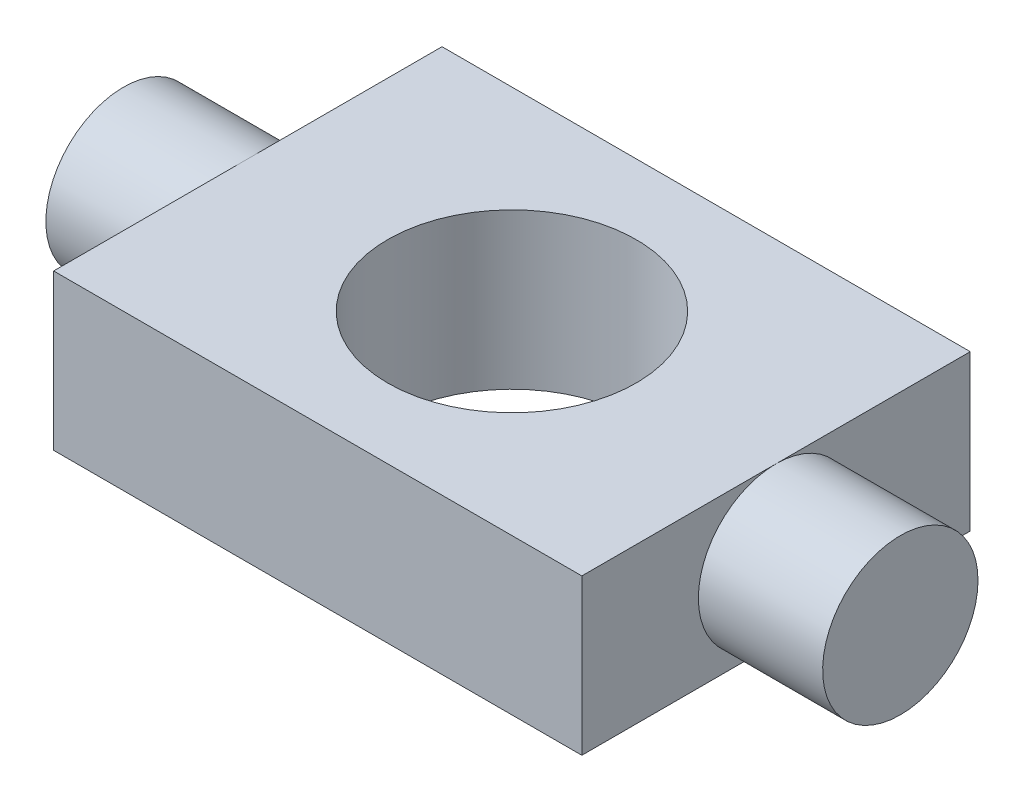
ISO-10303-21;
HEADER;
FILE_DESCRIPTION(('STEP AP214'),'2;1');
FILE_NAME('part.step','',(''),(''),'','','');
FILE_SCHEMA(('AUTOMOTIVE_DESIGN { 1 0 10303 214 1 1 1 1 }'));
ENDSEC;
DATA;
#1=APPLICATION_CONTEXT('core data for automotive mechanical design processes');
#2=APPLICATION_PROTOCOL_DEFINITION('international standard','automotive_design',2000,#1);
#3=PRODUCT_CONTEXT('',#1,'mechanical');
#4=PRODUCT('Part','Part','',(#3));
#5=PRODUCT_RELATED_PRODUCT_CATEGORY('part','',(#4));
#6=PRODUCT_DEFINITION_FORMATION('','',#4);
#7=PRODUCT_DEFINITION_CONTEXT('part definition',#1,'design');
#8=PRODUCT_DEFINITION('design','',#6,#7);
#9=PRODUCT_DEFINITION_SHAPE('','',#8);
#10=(LENGTH_UNIT() NAMED_UNIT(*) SI_UNIT(.MILLI.,.METRE.));
#11=(NAMED_UNIT(*) PLANE_ANGLE_UNIT() SI_UNIT($,.RADIAN.));
#12=(NAMED_UNIT(*) SI_UNIT($,.STERADIAN.) SOLID_ANGLE_UNIT());
#13=UNCERTAINTY_MEASURE_WITH_UNIT(LENGTH_MEASURE(1.E-05),#10,'distance_accuracy_value','');
#14=(GEOMETRIC_REPRESENTATION_CONTEXT(3) GLOBAL_UNCERTAINTY_ASSIGNED_CONTEXT((#13)) GLOBAL_UNIT_ASSIGNED_CONTEXT((#10,
#11,#12)) REPRESENTATION_CONTEXT('',''));
#15=CARTESIAN_POINT('',(0.,0.,0.));
#16=DIRECTION('',(0.,0.,1.));
#17=DIRECTION('',(1.,0.,0.));
#18=AXIS2_PLACEMENT_3D('',#15,#16,#17);
#19=CARTESIAN_POINT('',(0.,0.,25.));
#20=DIRECTION('',(1.,0.,0.));
#21=DIRECTION('',(0.,0.,-1.));
#22=AXIS2_PLACEMENT_3D('',#19,#20,#21);
#23=PLANE('',#22);
#24=DIRECTION('',(0.,0.,-1.));
#25=VECTOR('',#24,1.);
#26=CARTESIAN_POINT('',(0.,10.,25.));
#27=LINE('',#26,#25);
#28=CARTESIAN_POINT('',(0.,10.,25.));
#29=VERTEX_POINT('',#28);
#30=CARTESIAN_POINT('',(0.,10.,12.5));
#31=VERTEX_POINT('',#30);
#32=EDGE_CURVE('E85',#29,#31,#27,.T.);
#33=ORIENTED_EDGE('',*,*,#32,.T.);
#34=CARTESIAN_POINT('',(0.,5.,12.5));
#35=DIRECTION('',(1.,0.,0.));
#36=DIRECTION('',(0.,0.,-1.));
#37=AXIS2_PLACEMENT_3D('',#34,#35,#36);
#38=CIRCLE('',#37,5.);
#39=CARTESIAN_POINT('',(0.,0.,12.5));
#40=VERTEX_POINT('',#39);
#41=EDGE_CURVE('E35',#31,#40,#38,.T.);
#42=ORIENTED_EDGE('',*,*,#41,.T.);
#43=DIRECTION('',(0.,0.,-1.));
#44=VECTOR('',#43,1.);
#45=CARTESIAN_POINT('',(0.,0.,25.));
#46=LINE('',#45,#44);
#47=CARTESIAN_POINT('',(0.,0.,25.));
#48=VERTEX_POINT('',#47);
#49=EDGE_CURVE('E28',#48,#40,#46,.T.);
#50=ORIENTED_EDGE('',*,*,#49,.F.);
#51=DIRECTION('',(0.,-1.,0.));
#52=VECTOR('',#51,1.);
#53=CARTESIAN_POINT('',(0.,0.,25.));
#54=LINE('',#53,#52);
#55=EDGE_CURVE('E223',#29,#48,#54,.T.);
#56=ORIENTED_EDGE('',*,*,#55,.F.);
#57=EDGE_LOOP('',(#33,#42,#50,#56));
#58=FACE_BOUND('',#57,.T.);
#59=ADVANCED_FACE('F24',(#58),#23,.F.);
#60=CARTESIAN_POINT('',(34.,0.,25.));
#61=DIRECTION('',(-1.,0.,0.));
#62=DIRECTION('',(0.,0.,1.));
#63=AXIS2_PLACEMENT_3D('',#60,#61,#62);
#64=PLANE('',#63);
#65=CARTESIAN_POINT('',(34.,5.,12.5));
#66=DIRECTION('',(1.,0.,0.));
#67=DIRECTION('',(0.,0.,-1.));
#68=AXIS2_PLACEMENT_3D('',#65,#66,#67);
#69=CIRCLE('',#68,5.);
#70=CARTESIAN_POINT('',(34.,10.,12.5));
#71=VERTEX_POINT('',#70);
#72=CARTESIAN_POINT('',(34.,0.,12.5));
#73=VERTEX_POINT('',#72);
#74=EDGE_CURVE('E100',#71,#73,#69,.T.);
#75=ORIENTED_EDGE('',*,*,#74,.F.);
#76=DIRECTION('',(0.,0.,-1.));
#77=VECTOR('',#76,1.);
#78=CARTESIAN_POINT('',(34.,10.,25.));
#79=LINE('',#78,#77);
#80=CARTESIAN_POINT('',(34.,10.,25.));
#81=VERTEX_POINT('',#80);
#82=EDGE_CURVE('E233',#81,#71,#79,.T.);
#83=ORIENTED_EDGE('',*,*,#82,.F.);
#84=DIRECTION('',(0.,1.,0.));
#85=VECTOR('',#84,1.);
#86=CARTESIAN_POINT('',(34.,0.,25.));
#87=LINE('',#86,#85);
#88=CARTESIAN_POINT('',(34.,0.,25.));
#89=VERTEX_POINT('',#88);
#90=EDGE_CURVE('E226',#89,#81,#87,.T.);
#91=ORIENTED_EDGE('',*,*,#90,.F.);
#92=DIRECTION('',(0.,0.,-1.));
#93=VECTOR('',#92,1.);
#94=CARTESIAN_POINT('',(34.,0.,25.));
#95=LINE('',#94,#93);
#96=EDGE_CURVE('E94',#89,#73,#95,.T.);
#97=ORIENTED_EDGE('',*,*,#96,.T.);
#98=EDGE_LOOP('',(#75,#83,#91,#97));
#99=FACE_BOUND('',#98,.T.);
#100=ADVANCED_FACE('F122',(#99),#64,.F.);
#101=EDGE_CURVE('E33',#73,#71,#69,.T.);
#102=ORIENTED_EDGE('',*,*,#101,.F.);
#103=CARTESIAN_POINT('',(34.,0.,0.));
#104=VERTEX_POINT('',#103);
#105=EDGE_CURVE('E234',#73,#104,#95,.T.);
#106=ORIENTED_EDGE('',*,*,#105,.T.);
#107=DIRECTION('',(0.,1.,0.));
#108=VECTOR('',#107,1.);
#109=CARTESIAN_POINT('',(34.,0.,0.));
#110=LINE('',#109,#108);
#111=CARTESIAN_POINT('',(34.,10.,0.));
#112=VERTEX_POINT('',#111);
#113=EDGE_CURVE('E217',#104,#112,#110,.T.);
#114=ORIENTED_EDGE('',*,*,#113,.T.);
#115=EDGE_CURVE('E232',#71,#112,#79,.T.);
#116=ORIENTED_EDGE('',*,*,#115,.F.);
#117=EDGE_LOOP('',(#102,#106,#114,#116));
#118=FACE_BOUND('',#117,.T.);
#119=ADVANCED_FACE('F126',(#118),#64,.F.);
#120=CARTESIAN_POINT('',(0.,0.,0.));
#121=VERTEX_POINT('',#120);
#122=EDGE_CURVE('E88',#40,#121,#46,.T.);
#123=ORIENTED_EDGE('',*,*,#122,.F.);
#124=EDGE_CURVE('E11',#40,#31,#38,.T.);
#125=ORIENTED_EDGE('',*,*,#124,.T.);
#126=CARTESIAN_POINT('',(0.,10.,0.));
#127=VERTEX_POINT('',#126);
#128=EDGE_CURVE('E230',#31,#127,#27,.T.);
#129=ORIENTED_EDGE('',*,*,#128,.T.);
#130=DIRECTION('',(0.,-1.,0.));
#131=VECTOR('',#130,1.);
#132=CARTESIAN_POINT('',(0.,0.,0.));
#133=LINE('',#132,#131);
#134=EDGE_CURVE('E90',#127,#121,#133,.T.);
#135=ORIENTED_EDGE('',*,*,#134,.T.);
#136=EDGE_LOOP('',(#123,#125,#129,#135));
#137=FACE_BOUND('',#136,.T.);
#138=ADVANCED_FACE('F26',(#137),#23,.F.);
#139=CARTESIAN_POINT('',(0.,0.,25.));
#140=DIRECTION('',(0.,1.,0.));
#141=DIRECTION('',(0.,0.,1.));
#142=AXIS2_PLACEMENT_3D('',#139,#140,#141);
#143=PLANE('',#142);
#144=CARTESIAN_POINT('',(17.,0.,12.5));
#145=DIRECTION('',(0.,1.,0.));
#146=DIRECTION('',(0.,0.,1.));
#147=AXIS2_PLACEMENT_3D('',#144,#145,#146);
#148=CIRCLE('',#147,8.);
#149=CARTESIAN_POINT('',(17.,0.,20.5));
#150=VERTEX_POINT('',#149);
#151=EDGE_CURVE('E208',#150,#150,#148,.T.);
#152=ORIENTED_EDGE('',*,*,#151,.T.);
#153=EDGE_LOOP('',(#152));
#154=FACE_BOUND('',#153,.T.);
#155=DIRECTION('',(1.,0.,0.));
#156=VECTOR('',#155,1.);
#157=CARTESIAN_POINT('',(0.,0.,0.));
#158=LINE('',#157,#156);
#159=EDGE_CURVE('E215',#121,#104,#158,.T.);
#160=ORIENTED_EDGE('',*,*,#159,.T.);
#161=ORIENTED_EDGE('',*,*,#105,.F.);
#162=ORIENTED_EDGE('',*,*,#96,.F.);
#163=DIRECTION('',(1.,0.,0.));
#164=VECTOR('',#163,1.);
#165=CARTESIAN_POINT('',(0.,0.,25.));
#166=LINE('',#165,#164);
#167=EDGE_CURVE('E97',#48,#89,#166,.T.);
#168=ORIENTED_EDGE('',*,*,#167,.F.);
#169=ORIENTED_EDGE('',*,*,#49,.T.);
#170=ORIENTED_EDGE('',*,*,#122,.T.);
#171=EDGE_LOOP('',(#160,#161,#162,#168,#169,#170));
#172=FACE_BOUND('',#171,.T.);
#173=ADVANCED_FACE('F95',(#154,#172),#143,.F.);
#174=CARTESIAN_POINT('',(0.,10.,25.));
#175=DIRECTION('',(0.,-1.,0.));
#176=DIRECTION('',(0.,0.,-1.));
#177=AXIS2_PLACEMENT_3D('',#174,#175,#176);
#178=PLANE('',#177);
#179=CARTESIAN_POINT('',(17.,10.,12.5));
#180=DIRECTION('',(0.,1.,0.));
#181=DIRECTION('',(0.,0.,1.));
#182=AXIS2_PLACEMENT_3D('',#179,#180,#181);
#183=CIRCLE('',#182,8.);
#184=CARTESIAN_POINT('',(17.,10.,20.5));
#185=VERTEX_POINT('',#184);
#186=EDGE_CURVE('E108',#185,#185,#183,.T.);
#187=ORIENTED_EDGE('',*,*,#186,.F.);
#188=EDGE_LOOP('',(#187));
#189=FACE_BOUND('',#188,.T.);
#190=DIRECTION('',(-1.,0.,0.));
#191=VECTOR('',#190,1.);
#192=CARTESIAN_POINT('',(0.,10.,0.));
#193=LINE('',#192,#191);
#194=EDGE_CURVE('E220',#112,#127,#193,.T.);
#195=ORIENTED_EDGE('',*,*,#194,.T.);
#196=ORIENTED_EDGE('',*,*,#128,.F.);
#197=ORIENTED_EDGE('',*,*,#32,.F.);
#198=DIRECTION('',(-1.,0.,0.));
#199=VECTOR('',#198,1.);
#200=CARTESIAN_POINT('',(0.,10.,25.));
#201=LINE('',#200,#199);
#202=EDGE_CURVE('E228',#81,#29,#201,.T.);
#203=ORIENTED_EDGE('',*,*,#202,.F.);
#204=ORIENTED_EDGE('',*,*,#82,.T.);
#205=ORIENTED_EDGE('',*,*,#115,.T.);
#206=EDGE_LOOP('',(#195,#196,#197,#203,#204,#205));
#207=FACE_BOUND('',#206,.T.);
#208=ADVANCED_FACE('F134',(#189,#207),#178,.F.);
#209=CARTESIAN_POINT('',(0.,10.,25.));
#210=DIRECTION('',(0.,0.,-1.));
#211=DIRECTION('',(-1.,0.,0.));
#212=AXIS2_PLACEMENT_3D('',#209,#210,#211);
#213=PLANE('',#212);
#214=ORIENTED_EDGE('',*,*,#55,.T.);
#215=ORIENTED_EDGE('',*,*,#167,.T.);
#216=ORIENTED_EDGE('',*,*,#90,.T.);
#217=ORIENTED_EDGE('',*,*,#202,.T.);
#218=EDGE_LOOP('',(#214,#215,#216,#217));
#219=FACE_BOUND('',#218,.T.);
#220=ADVANCED_FACE('F141',(#219),#213,.F.);
#221=CARTESIAN_POINT('',(0.,10.,0.));
#222=DIRECTION('',(0.,0.,-1.));
#223=DIRECTION('',(-1.,0.,0.));
#224=AXIS2_PLACEMENT_3D('',#221,#222,#223);
#225=PLANE('',#224);
#226=ORIENTED_EDGE('',*,*,#134,.F.);
#227=ORIENTED_EDGE('',*,*,#194,.F.);
#228=ORIENTED_EDGE('',*,*,#113,.F.);
#229=ORIENTED_EDGE('',*,*,#159,.F.);
#230=EDGE_LOOP('',(#226,#227,#228,#229));
#231=FACE_BOUND('',#230,.T.);
#232=ADVANCED_FACE('F145',(#231),#225,.T.);
#233=CARTESIAN_POINT('',(17.,0.,12.5));
#234=DIRECTION('',(0.,1.,0.));
#235=DIRECTION('',(0.,0.,1.));
#236=AXIS2_PLACEMENT_3D('',#233,#234,#235);
#237=CYLINDRICAL_SURFACE('',#236,8.);
#238=ORIENTED_EDGE('',*,*,#151,.F.);
#239=EDGE_LOOP('',(#238));
#240=FACE_BOUND('',#239,.T.);
#241=ORIENTED_EDGE('',*,*,#186,.T.);
#242=EDGE_LOOP('',(#241));
#243=FACE_BOUND('',#242,.T.);
#244=ADVANCED_FACE('F149',(#240,#243),#237,.F.);
#245=CARTESIAN_POINT('',(42.,5.,12.5));
#246=DIRECTION('',(-1.,0.,0.));
#247=DIRECTION('',(0.,0.,1.));
#248=AXIS2_PLACEMENT_3D('',#245,#246,#247);
#249=CYLINDRICAL_SURFACE('',#248,5.);
#250=CARTESIAN_POINT('',(42.,5.,12.5));
#251=DIRECTION('',(1.,0.,0.));
#252=DIRECTION('',(0.,0.,-1.));
#253=AXIS2_PLACEMENT_3D('',#250,#251,#252);
#254=CIRCLE('',#253,5.);
#255=CARTESIAN_POINT('',(42.,5.,7.5));
#256=VERTEX_POINT('',#255);
#257=EDGE_CURVE('E105',#256,#256,#254,.T.);
#258=ORIENTED_EDGE('',*,*,#257,.F.);
#259=EDGE_LOOP('',(#258));
#260=FACE_BOUND('',#259,.T.);
#261=ORIENTED_EDGE('',*,*,#74,.T.);
#262=ORIENTED_EDGE('',*,*,#101,.T.);
#263=EDGE_LOOP('',(#261,#262));
#264=FACE_BOUND('',#263,.T.);
#265=ADVANCED_FACE('F153',(#260,#264),#249,.T.);
#266=CARTESIAN_POINT('',(42.,5.,12.5));
#267=DIRECTION('',(1.,0.,0.));
#268=DIRECTION('',(0.,0.,-1.));
#269=AXIS2_PLACEMENT_3D('',#266,#267,#268);
#270=PLANE('',#269);
#271=ORIENTED_EDGE('',*,*,#257,.T.);
#272=EDGE_LOOP('',(#271));
#273=FACE_BOUND('',#272,.T.);
#274=ADVANCED_FACE('F119',(#273),#270,.T.);
#275=CARTESIAN_POINT('',(-8.,5.,12.5));
#276=DIRECTION('',(1.,0.,0.));
#277=DIRECTION('',(0.,0.,-1.));
#278=AXIS2_PLACEMENT_3D('',#275,#276,#277);
#279=CYLINDRICAL_SURFACE('',#278,5.);
#280=CARTESIAN_POINT('',(-8.,5.,12.5));
#281=DIRECTION('',(1.,0.,0.));
#282=DIRECTION('',(0.,0.,-1.));
#283=AXIS2_PLACEMENT_3D('',#280,#281,#282);
#284=CIRCLE('',#283,5.);
#285=CARTESIAN_POINT('',(-8.,5.,7.5));
#286=VERTEX_POINT('',#285);
#287=EDGE_CURVE('E86',#286,#286,#284,.T.);
#288=ORIENTED_EDGE('',*,*,#287,.T.);
#289=EDGE_LOOP('',(#288));
#290=FACE_BOUND('',#289,.T.);
#291=ORIENTED_EDGE('',*,*,#41,.F.);
#292=ORIENTED_EDGE('',*,*,#124,.F.);
#293=EDGE_LOOP('',(#291,#292));
#294=FACE_BOUND('',#293,.T.);
#295=ADVANCED_FACE('F75',(#290,#294),#279,.T.);
#296=CARTESIAN_POINT('',(-8.,5.,12.5));
#297=DIRECTION('',(-1.,0.,0.));
#298=DIRECTION('',(0.,0.,-1.));
#299=AXIS2_PLACEMENT_3D('',#296,#297,#298);
#300=PLANE('',#299);
#301=ORIENTED_EDGE('',*,*,#287,.F.);
#302=EDGE_LOOP('',(#301));
#303=FACE_BOUND('',#302,.T.);
#304=ADVANCED_FACE('F113',(#303),#300,.T.);
#305=CLOSED_SHELL('',(#59,#100,#119,#138,#173,#208,#220,#232,#244,#265,#274,#295,#304));
#306=MANIFOLD_SOLID_BREP('B2',#305);
#307=ADVANCED_BREP_SHAPE_REPRESENTATION('',(#18,#306),#14);
#308=SHAPE_DEFINITION_REPRESENTATION(#9,#307);
ENDSEC;
END-ISO-10303-21;
